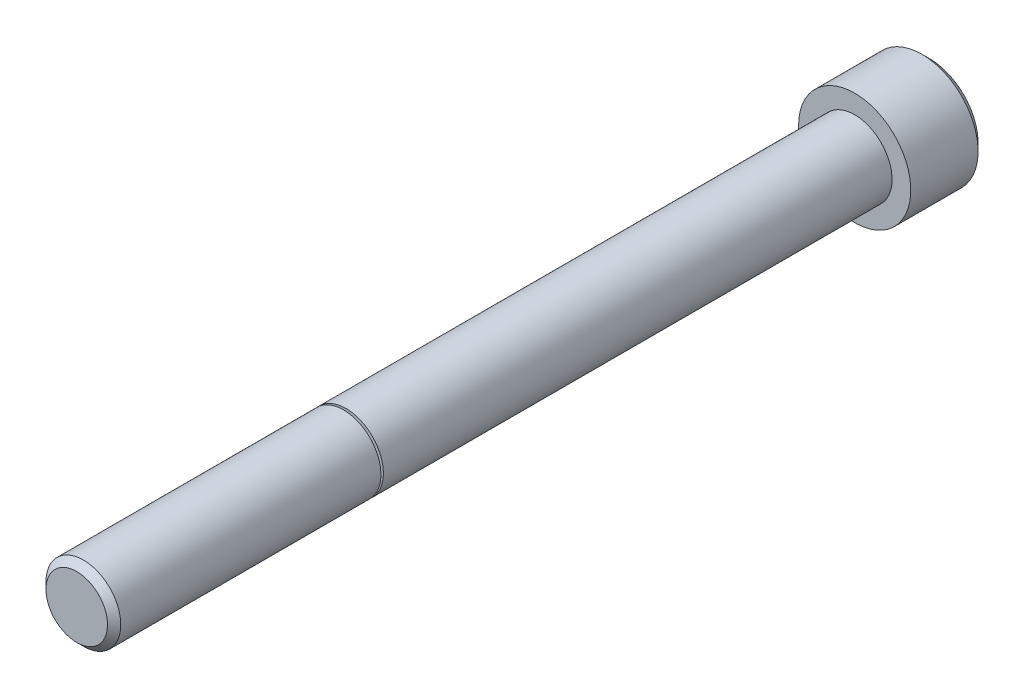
ISO-10303-21;
HEADER;
FILE_DESCRIPTION(('STEP AP214'),'2;1');
FILE_NAME('part.step','',(''),(''),'','','');
FILE_SCHEMA(('AUTOMOTIVE_DESIGN { 1 0 10303 214 1 1 1 1 }'));
ENDSEC;
DATA;
#1=APPLICATION_CONTEXT('core data for automotive mechanical design processes');
#2=APPLICATION_PROTOCOL_DEFINITION('international standard','automotive_design',2000,#1);
#3=PRODUCT_CONTEXT('',#1,'mechanical');
#4=PRODUCT('Part','Part','',(#3));
#5=PRODUCT_RELATED_PRODUCT_CATEGORY('part','',(#4));
#6=PRODUCT_DEFINITION_FORMATION('','',#4);
#7=PRODUCT_DEFINITION_CONTEXT('part definition',#1,'design');
#8=PRODUCT_DEFINITION('design','',#6,#7);
#9=PRODUCT_DEFINITION_SHAPE('','',#8);
#10=(LENGTH_UNIT() NAMED_UNIT(*) SI_UNIT(.MILLI.,.METRE.));
#11=(NAMED_UNIT(*) PLANE_ANGLE_UNIT() SI_UNIT($,.RADIAN.));
#12=(NAMED_UNIT(*) SI_UNIT($,.STERADIAN.) SOLID_ANGLE_UNIT());
#13=UNCERTAINTY_MEASURE_WITH_UNIT(LENGTH_MEASURE(1.E-05),#10,'distance_accuracy_value','');
#14=(GEOMETRIC_REPRESENTATION_CONTEXT(3) GLOBAL_UNCERTAINTY_ASSIGNED_CONTEXT((#13)) GLOBAL_UNIT_ASSIGNED_CONTEXT((#10,
#11,#12)) REPRESENTATION_CONTEXT('',''));
#15=CARTESIAN_POINT('',(0.,0.,0.));
#16=DIRECTION('',(0.,0.,1.));
#17=DIRECTION('',(1.,0.,0.));
#18=AXIS2_PLACEMENT_3D('',#15,#16,#17);
#19=CARTESIAN_POINT('',(0.,0.,-7.9375));
#20=DIRECTION('',(0.,0.,1.));
#21=DIRECTION('',(1.,0.,0.));
#22=AXIS2_PLACEMENT_3D('',#19,#20,#21);
#23=PLANE('',#22);
#24=DIRECTION('',(-0.5,-0.866025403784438,0.));
#25=VECTOR('',#24,1.);
#26=CARTESIAN_POINT('',(3.66617420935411,0.,-7.9375));
#27=LINE('',#26,#25);
#28=CARTESIAN_POINT('',(3.66617420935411,0.,-7.9375));
#29=VERTEX_POINT('',#28);
#30=CARTESIAN_POINT('',(1.83308710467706,-3.17500000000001,-7.9375));
#31=VERTEX_POINT('',#30);
#32=EDGE_CURVE('E145',#29,#31,#27,.T.);
#33=ORIENTED_EDGE('',*,*,#32,.F.);
#34=DIRECTION('',(0.499999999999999,-0.866025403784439,0.));
#35=VECTOR('',#34,1.);
#36=CARTESIAN_POINT('',(1.83308710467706,3.175,-7.9375));
#37=LINE('',#36,#35);
#38=CARTESIAN_POINT('',(1.83308710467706,3.175,-7.9375));
#39=VERTEX_POINT('',#38);
#40=EDGE_CURVE('E64',#39,#29,#37,.T.);
#41=ORIENTED_EDGE('',*,*,#40,.F.);
#42=DIRECTION('',(1.,0.,0.));
#43=VECTOR('',#42,1.);
#44=CARTESIAN_POINT('',(-1.83308710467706,3.175,-7.9375));
#45=LINE('',#44,#43);
#46=CARTESIAN_POINT('',(-1.83308710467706,3.175,-7.9375));
#47=VERTEX_POINT('',#46);
#48=EDGE_CURVE('E158',#47,#39,#45,.T.);
#49=ORIENTED_EDGE('',*,*,#48,.F.);
#50=DIRECTION('',(0.5,0.866025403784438,0.));
#51=VECTOR('',#50,1.);
#52=CARTESIAN_POINT('',(-3.66617420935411,0.,-7.9375));
#53=LINE('',#52,#51);
#54=CARTESIAN_POINT('',(-3.66617420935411,0.,-7.9375));
#55=VERTEX_POINT('',#54);
#56=EDGE_CURVE('E155',#55,#47,#53,.T.);
#57=ORIENTED_EDGE('',*,*,#56,.F.);
#58=DIRECTION('',(-0.5,0.866025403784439,0.));
#59=VECTOR('',#58,1.);
#60=CARTESIAN_POINT('',(-1.83308710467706,-3.17500000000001,-7.9375));
#61=LINE('',#60,#59);
#62=CARTESIAN_POINT('',(-1.83308710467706,-3.17500000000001,-7.9375));
#63=VERTEX_POINT('',#62);
#64=EDGE_CURVE('E112',#63,#55,#61,.T.);
#65=ORIENTED_EDGE('',*,*,#64,.F.);
#66=DIRECTION('',(-1.,0.,0.));
#67=VECTOR('',#66,1.);
#68=CARTESIAN_POINT('',(1.83308710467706,-3.17500000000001,-7.9375));
#69=LINE('',#68,#67);
#70=EDGE_CURVE('E149',#31,#63,#69,.T.);
#71=ORIENTED_EDGE('',*,*,#70,.F.);
#72=EDGE_LOOP('',(#33,#41,#49,#57,#65,#71));
#73=FACE_BOUND('',#72,.T.);
#74=CARTESIAN_POINT('',(0.,0.,-7.9375));
#75=DIRECTION('',(0.,0.,-1.));
#76=DIRECTION('',(-1.,0.,0.));
#77=AXIS2_PLACEMENT_3D('',#74,#75,#76);
#78=CIRCLE('',#77,5.15937500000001);
#79=CARTESIAN_POINT('',(-5.15937500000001,0.,-7.9375));
#80=VERTEX_POINT('',#79);
#81=EDGE_CURVE('E164',#80,#80,#78,.T.);
#82=ORIENTED_EDGE('',*,*,#81,.T.);
#83=EDGE_LOOP('',(#82));
#84=FACE_BOUND('',#83,.T.);
#85=ADVANCED_FACE('F49',(#73,#84),#23,.F.);
#86=CARTESIAN_POINT('',(-3.26390000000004,0.,82.55));
#87=DIRECTION('',(0.,0.,-1.));
#88=DIRECTION('',(-1.,0.,0.));
#89=AXIS2_PLACEMENT_3D('',#86,#87,#88);
#90=PLANE('',#89);
#91=CARTESIAN_POINT('',(0.,0.,82.55));
#92=DIRECTION('',(0.,0.,-1.));
#93=DIRECTION('',(-1.,0.,0.));
#94=AXIS2_PLACEMENT_3D('',#91,#92,#93);
#95=CIRCLE('',#94,3.26390000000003);
#96=CARTESIAN_POINT('',(-3.26390000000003,0.,82.55));
#97=VERTEX_POINT('',#96);
#98=EDGE_CURVE('E11',#97,#97,#95,.T.);
#99=ORIENTED_EDGE('',*,*,#98,.F.);
#100=EDGE_LOOP('',(#99));
#101=FACE_BOUND('',#100,.T.);
#102=ADVANCED_FACE('F214',(#101),#90,.F.);
#103=CARTESIAN_POINT('',(0.,0.,82.55));
#104=DIRECTION('',(0.,0.,-1.));
#105=DIRECTION('',(-1.,0.,0.));
#106=AXIS2_PLACEMENT_3D('',#103,#104,#105);
#107=CONICAL_SURFACE('',#106,3.26390000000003,0.785398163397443);
#108=CARTESIAN_POINT('',(0.,0.,81.84515));
#109=DIRECTION('',(0.,0.,-1.));
#110=DIRECTION('',(-1.,0.,0.));
#111=AXIS2_PLACEMENT_3D('',#108,#109,#110);
#112=CIRCLE('',#111,3.96875000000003);
#113=CARTESIAN_POINT('',(-3.96875000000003,0.,81.84515));
#114=VERTEX_POINT('',#113);
#115=EDGE_CURVE('E57',#114,#114,#112,.T.);
#116=ORIENTED_EDGE('',*,*,#115,.F.);
#117=EDGE_LOOP('',(#116));
#118=FACE_BOUND('',#117,.T.);
#119=ORIENTED_EDGE('',*,*,#98,.T.);
#120=EDGE_LOOP('',(#119));
#121=FACE_BOUND('',#120,.T.);
#122=ADVANCED_FACE('F211',(#118,#121),#107,.T.);
#123=CARTESIAN_POINT('',(0.,0.,-10.585154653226));
#124=DIRECTION('',(0.,0.,-1.));
#125=DIRECTION('',(-1.,0.,0.));
#126=AXIS2_PLACEMENT_3D('',#123,#124,#125);
#127=CYLINDRICAL_SURFACE('',#126,3.96875000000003);
#128=CARTESIAN_POINT('',(0.,0.,54.2415444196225));
#129=DIRECTION('',(0.,0.,-1.));
#130=DIRECTION('',(-1.,0.,0.));
#131=AXIS2_PLACEMENT_3D('',#128,#129,#130);
#132=CIRCLE('',#131,3.96875000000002);
#133=CARTESIAN_POINT('',(-3.96875000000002,0.,54.2415444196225));
#134=VERTEX_POINT('',#133);
#135=EDGE_CURVE('E201',#134,#134,#132,.T.);
#136=ORIENTED_EDGE('',*,*,#135,.F.);
#137=EDGE_LOOP('',(#136));
#138=FACE_BOUND('',#137,.T.);
#139=ORIENTED_EDGE('',*,*,#115,.T.);
#140=EDGE_LOOP('',(#139));
#141=FACE_BOUND('',#140,.T.);
#142=ADVANCED_FACE('F209',(#138,#141),#127,.T.);
#143=CARTESIAN_POINT('',(0.,0.,54.2415444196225));
#144=DIRECTION('',(0.,0.,1.));
#145=DIRECTION('',(1.,0.,0.));
#146=AXIS2_PLACEMENT_3D('',#143,#144,#145);
#147=CONICAL_SURFACE('',#146,3.96875000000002,1.22173047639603);
#148=CARTESIAN_POINT('',(0.,0.,54.0237938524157));
#149=DIRECTION('',(0.,0.,-1.));
#150=DIRECTION('',(-1.,0.,0.));
#151=AXIS2_PLACEMENT_3D('',#148,#149,#150);
#152=CIRCLE('',#151,3.37048523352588);
#153=CARTESIAN_POINT('',(-3.37048523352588,0.,54.0237938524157));
#154=VERTEX_POINT('',#153);
#155=EDGE_CURVE('E197',#154,#154,#152,.T.);
#156=ORIENTED_EDGE('',*,*,#155,.F.);
#157=EDGE_LOOP('',(#156));
#158=FACE_BOUND('',#157,.T.);
#159=ORIENTED_EDGE('',*,*,#135,.T.);
#160=EDGE_LOOP('',(#159));
#161=FACE_BOUND('',#160,.T.);
#162=ADVANCED_FACE('F226',(#158,#161),#147,.T.);
#163=CARTESIAN_POINT('',(0.,0.,54.005));
#164=DIRECTION('',(0.,0.,-1.));
#165=DIRECTION('',(-1.,0.,0.));
#166=AXIS2_PLACEMENT_3D('',#163,#164,#165);
#167=TOROIDAL_SURFACE('',#166,3.37732563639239,0.0199999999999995);
#168=CARTESIAN_POINT('',(0.,0.,53.985));
#169=DIRECTION('',(0.,0.,-1.));
#170=DIRECTION('',(-1.,0.,0.));
#171=AXIS2_PLACEMENT_3D('',#168,#169,#170);
#172=CIRCLE('',#171,3.37732563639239);
#173=CARTESIAN_POINT('',(-3.37732563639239,0.,53.985));
#174=VERTEX_POINT('',#173);
#175=EDGE_CURVE('E193',#174,#174,#172,.T.);
#176=ORIENTED_EDGE('',*,*,#175,.F.);
#177=EDGE_LOOP('',(#176));
#178=FACE_BOUND('',#177,.T.);
#179=ORIENTED_EDGE('',*,*,#155,.T.);
#180=EDGE_LOOP('',(#179));
#181=FACE_BOUND('',#180,.T.);
#182=ADVANCED_FACE('F230',(#178,#181),#167,.F.);
#183=CARTESIAN_POINT('',(-3.96875000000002,0.,53.985));
#184=DIRECTION('',(0.,0.,-1.));
#185=DIRECTION('',(-1.,0.,0.));
#186=AXIS2_PLACEMENT_3D('',#183,#184,#185);
#187=PLANE('',#186);
#188=CARTESIAN_POINT('',(0.,0.,53.985));
#189=DIRECTION('',(0.,0.,-1.));
#190=DIRECTION('',(-1.,0.,0.));
#191=AXIS2_PLACEMENT_3D('',#188,#189,#190);
#192=CIRCLE('',#191,3.96875000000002);
#193=CARTESIAN_POINT('',(-3.96875000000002,0.,53.985));
#194=VERTEX_POINT('',#193);
#195=EDGE_CURVE('E189',#194,#194,#192,.T.);
#196=ORIENTED_EDGE('',*,*,#195,.F.);
#197=EDGE_LOOP('',(#196));
#198=FACE_BOUND('',#197,.T.);
#199=ORIENTED_EDGE('',*,*,#175,.T.);
#200=EDGE_LOOP('',(#199));
#201=FACE_BOUND('',#200,.T.);
#202=ADVANCED_FACE('F234',(#198,#201),#187,.F.);
#203=CARTESIAN_POINT('',(0.,0.,-10.585154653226));
#204=DIRECTION('',(0.,0.,-1.));
#205=DIRECTION('',(-1.,0.,0.));
#206=AXIS2_PLACEMENT_3D('',#203,#204,#205);
#207=CYLINDRICAL_SURFACE('',#206,3.96875000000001);
#208=CARTESIAN_POINT('',(0.,0.,0.));
#209=DIRECTION('',(0.,0.,-1.));
#210=DIRECTION('',(-1.,0.,0.));
#211=AXIS2_PLACEMENT_3D('',#208,#209,#210);
#212=CIRCLE('',#211,3.96875);
#213=CARTESIAN_POINT('',(-3.96875,0.,0.));
#214=VERTEX_POINT('',#213);
#215=EDGE_CURVE('E185',#214,#214,#212,.T.);
#216=ORIENTED_EDGE('',*,*,#215,.F.);
#217=EDGE_LOOP('',(#216));
#218=FACE_BOUND('',#217,.T.);
#219=ORIENTED_EDGE('',*,*,#195,.T.);
#220=EDGE_LOOP('',(#219));
#221=FACE_BOUND('',#220,.T.);
#222=ADVANCED_FACE('F238',(#218,#221),#207,.T.);
#223=CARTESIAN_POINT('',(-5.953125,0.,0.));
#224=DIRECTION('',(0.,0.,-1.));
#225=DIRECTION('',(-1.,0.,0.));
#226=AXIS2_PLACEMENT_3D('',#223,#224,#225);
#227=PLANE('',#226);
#228=CARTESIAN_POINT('',(0.,0.,0.));
#229=DIRECTION('',(0.,0.,-1.));
#230=DIRECTION('',(-1.,0.,0.));
#231=AXIS2_PLACEMENT_3D('',#228,#229,#230);
#232=CIRCLE('',#231,5.95312500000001);
#233=CARTESIAN_POINT('',(-5.95312500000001,0.,0.));
#234=VERTEX_POINT('',#233);
#235=EDGE_CURVE('E181',#234,#234,#232,.T.);
#236=ORIENTED_EDGE('',*,*,#235,.F.);
#237=EDGE_LOOP('',(#236));
#238=FACE_BOUND('',#237,.T.);
#239=ORIENTED_EDGE('',*,*,#215,.T.);
#240=EDGE_LOOP('',(#239));
#241=FACE_BOUND('',#240,.T.);
#242=ADVANCED_FACE('F242',(#238,#241),#227,.F.);
#243=CARTESIAN_POINT('',(0.,0.,-10.585154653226));
#244=DIRECTION('',(0.,0.,-1.));
#245=DIRECTION('',(-1.,0.,0.));
#246=AXIS2_PLACEMENT_3D('',#243,#244,#245);
#247=CYLINDRICAL_SURFACE('',#246,5.953125);
#248=CARTESIAN_POINT('',(0.,0.,-7.14375));
#249=DIRECTION('',(0.,0.,-1.));
#250=DIRECTION('',(-1.,0.,0.));
#251=AXIS2_PLACEMENT_3D('',#248,#249,#250);
#252=CIRCLE('',#251,5.953125);
#253=CARTESIAN_POINT('',(-5.953125,0.,-7.14375));
#254=VERTEX_POINT('',#253);
#255=EDGE_CURVE('E177',#254,#254,#252,.T.);
#256=ORIENTED_EDGE('',*,*,#255,.F.);
#257=EDGE_LOOP('',(#256));
#258=FACE_BOUND('',#257,.T.);
#259=ORIENTED_EDGE('',*,*,#235,.T.);
#260=EDGE_LOOP('',(#259));
#261=FACE_BOUND('',#260,.T.);
#262=ADVANCED_FACE('F246',(#258,#261),#247,.T.);
#263=CARTESIAN_POINT('',(0.,0.,-7.14375));
#264=DIRECTION('',(0.,0.,1.));
#265=DIRECTION('',(1.,0.,0.));
#266=AXIS2_PLACEMENT_3D('',#263,#264,#265);
#267=CONICAL_SURFACE('',#266,5.953125,0.785398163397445);
#268=ORIENTED_EDGE('',*,*,#81,.F.);
#269=EDGE_LOOP('',(#268));
#270=FACE_BOUND('',#269,.T.);
#271=ORIENTED_EDGE('',*,*,#255,.T.);
#272=EDGE_LOOP('',(#271));
#273=FACE_BOUND('',#272,.T.);
#274=ADVANCED_FACE('F250',(#270,#273),#267,.T.);
#275=CARTESIAN_POINT('',(1.83308710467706,3.175,-3.96875));
#276=DIRECTION('',(0.866025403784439,0.5,0.));
#277=DIRECTION('',(-0.5,0.866025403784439,0.));
#278=AXIS2_PLACEMENT_3D('',#275,#276,#277);
#279=PLANE('',#278);
#280=ORIENTED_EDGE('',*,*,#40,.T.);
#281=DIRECTION('',(0.,0.,-1.));
#282=VECTOR('',#281,1.);
#283=CARTESIAN_POINT('',(3.66617420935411,0.,-3.96875));
#284=LINE('',#283,#282);
#285=CARTESIAN_POINT('',(3.66617420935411,0.,-3.96875));
#286=VERTEX_POINT('',#285);
#287=EDGE_CURVE('E94',#286,#29,#284,.T.);
#288=ORIENTED_EDGE('',*,*,#287,.F.);
#289=DIRECTION('',(0.499999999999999,-0.866025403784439,0.));
#290=VECTOR('',#289,1.);
#291=CARTESIAN_POINT('',(1.83308710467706,3.175,-3.96875));
#292=LINE('',#291,#290);
#293=CARTESIAN_POINT('',(1.83308710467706,3.175,-3.96875));
#294=VERTEX_POINT('',#293);
#295=EDGE_CURVE('E161',#294,#286,#292,.T.);
#296=ORIENTED_EDGE('',*,*,#295,.F.);
#297=DIRECTION('',(0.,0.,-1.));
#298=VECTOR('',#297,1.);
#299=CARTESIAN_POINT('',(1.83308710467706,3.175,-3.96875));
#300=LINE('',#299,#298);
#301=EDGE_CURVE('E72',#294,#39,#300,.T.);
#302=ORIENTED_EDGE('',*,*,#301,.T.);
#303=EDGE_LOOP('',(#280,#288,#296,#302));
#304=FACE_BOUND('',#303,.T.);
#305=ADVANCED_FACE('F254',(#304),#279,.F.);
#306=CARTESIAN_POINT('',(-1.83308710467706,3.175,-3.96875));
#307=DIRECTION('',(0.,1.,0.));
#308=DIRECTION('',(-1.,0.,0.));
#309=AXIS2_PLACEMENT_3D('',#306,#307,#308);
#310=PLANE('',#309);
#311=ORIENTED_EDGE('',*,*,#48,.T.);
#312=ORIENTED_EDGE('',*,*,#301,.F.);
#313=DIRECTION('',(1.,0.,0.));
#314=VECTOR('',#313,1.);
#315=CARTESIAN_POINT('',(-1.83308710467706,3.175,-3.96875));
#316=LINE('',#315,#314);
#317=CARTESIAN_POINT('',(-1.83308710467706,3.175,-3.96875));
#318=VERTEX_POINT('',#317);
#319=EDGE_CURVE('E126',#318,#294,#316,.T.);
#320=ORIENTED_EDGE('',*,*,#319,.F.);
#321=DIRECTION('',(0.,0.,-1.));
#322=VECTOR('',#321,1.);
#323=CARTESIAN_POINT('',(-1.83308710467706,3.175,-3.96875));
#324=LINE('',#323,#322);
#325=EDGE_CURVE('E117',#318,#47,#324,.T.);
#326=ORIENTED_EDGE('',*,*,#325,.T.);
#327=EDGE_LOOP('',(#311,#312,#320,#326));
#328=FACE_BOUND('',#327,.T.);
#329=ADVANCED_FACE('F258',(#328),#310,.F.);
#330=CARTESIAN_POINT('',(-3.66617420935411,0.,-3.96875));
#331=DIRECTION('',(-0.866025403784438,0.5,0.));
#332=DIRECTION('',(-0.5,-0.866025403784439,0.));
#333=AXIS2_PLACEMENT_3D('',#330,#331,#332);
#334=PLANE('',#333);
#335=ORIENTED_EDGE('',*,*,#56,.T.);
#336=ORIENTED_EDGE('',*,*,#325,.F.);
#337=DIRECTION('',(0.5,0.866025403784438,0.));
#338=VECTOR('',#337,1.);
#339=CARTESIAN_POINT('',(-3.66617420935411,0.,-3.96875));
#340=LINE('',#339,#338);
#341=CARTESIAN_POINT('',(-3.66617420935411,0.,-3.96875));
#342=VERTEX_POINT('',#341);
#343=EDGE_CURVE('E121',#342,#318,#340,.T.);
#344=ORIENTED_EDGE('',*,*,#343,.F.);
#345=DIRECTION('',(0.,0.,-1.));
#346=VECTOR('',#345,1.);
#347=CARTESIAN_POINT('',(-3.66617420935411,0.,-3.96875));
#348=LINE('',#347,#346);
#349=EDGE_CURVE('E105',#342,#55,#348,.T.);
#350=ORIENTED_EDGE('',*,*,#349,.T.);
#351=EDGE_LOOP('',(#335,#336,#344,#350));
#352=FACE_BOUND('',#351,.T.);
#353=ADVANCED_FACE('F122',(#352),#334,.F.);
#354=CARTESIAN_POINT('',(-1.83308710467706,-3.17500000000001,-3.96875));
#355=DIRECTION('',(-0.866025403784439,-0.5,0.));
#356=DIRECTION('',(0.5,-0.866025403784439,0.));
#357=AXIS2_PLACEMENT_3D('',#354,#355,#356);
#358=PLANE('',#357);
#359=ORIENTED_EDGE('',*,*,#64,.T.);
#360=ORIENTED_EDGE('',*,*,#349,.F.);
#361=DIRECTION('',(-0.5,0.866025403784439,0.));
#362=VECTOR('',#361,1.);
#363=CARTESIAN_POINT('',(-1.83308710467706,-3.17500000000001,-3.96875));
#364=LINE('',#363,#362);
#365=CARTESIAN_POINT('',(-1.83308710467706,-3.17500000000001,-3.96875));
#366=VERTEX_POINT('',#365);
#367=EDGE_CURVE('E109',#366,#342,#364,.T.);
#368=ORIENTED_EDGE('',*,*,#367,.F.);
#369=DIRECTION('',(0.,0.,-1.));
#370=VECTOR('',#369,1.);
#371=CARTESIAN_POINT('',(-1.83308710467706,-3.17500000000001,-3.96875));
#372=LINE('',#371,#370);
#373=EDGE_CURVE('E118',#366,#63,#372,.T.);
#374=ORIENTED_EDGE('',*,*,#373,.T.);
#375=EDGE_LOOP('',(#359,#360,#368,#374));
#376=FACE_BOUND('',#375,.T.);
#377=ADVANCED_FACE('F107',(#376),#358,.F.);
#378=CARTESIAN_POINT('',(1.83308710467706,-3.17500000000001,-3.96875));
#379=DIRECTION('',(0.,-1.,0.));
#380=DIRECTION('',(0.,0.,-1.));
#381=AXIS2_PLACEMENT_3D('',#378,#379,#380);
#382=PLANE('',#381);
#383=ORIENTED_EDGE('',*,*,#70,.T.);
#384=ORIENTED_EDGE('',*,*,#373,.F.);
#385=DIRECTION('',(-1.,0.,0.));
#386=VECTOR('',#385,1.);
#387=CARTESIAN_POINT('',(1.83308710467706,-3.17500000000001,-3.96875));
#388=LINE('',#387,#386);
#389=CARTESIAN_POINT('',(1.83308710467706,-3.17500000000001,-3.96875));
#390=VERTEX_POINT('',#389);
#391=EDGE_CURVE('E132',#390,#366,#388,.T.);
#392=ORIENTED_EDGE('',*,*,#391,.F.);
#393=DIRECTION('',(0.,0.,-1.));
#394=VECTOR('',#393,1.);
#395=CARTESIAN_POINT('',(1.83308710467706,-3.17500000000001,-3.96875));
#396=LINE('',#395,#394);
#397=EDGE_CURVE('E169',#390,#31,#396,.T.);
#398=ORIENTED_EDGE('',*,*,#397,.T.);
#399=EDGE_LOOP('',(#383,#384,#392,#398));
#400=FACE_BOUND('',#399,.T.);
#401=ADVANCED_FACE('F262',(#400),#382,.F.);
#402=CARTESIAN_POINT('',(3.66617420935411,0.,-3.96875));
#403=DIRECTION('',(0.866025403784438,-0.5,0.));
#404=DIRECTION('',(0.5,0.866025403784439,0.));
#405=AXIS2_PLACEMENT_3D('',#402,#403,#404);
#406=PLANE('',#405);
#407=ORIENTED_EDGE('',*,*,#32,.T.);
#408=ORIENTED_EDGE('',*,*,#397,.F.);
#409=DIRECTION('',(-0.5,-0.866025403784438,0.));
#410=VECTOR('',#409,1.);
#411=CARTESIAN_POINT('',(3.66617420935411,0.,-3.96875));
#412=LINE('',#411,#410);
#413=EDGE_CURVE('E137',#286,#390,#412,.T.);
#414=ORIENTED_EDGE('',*,*,#413,.F.);
#415=ORIENTED_EDGE('',*,*,#287,.T.);
#416=EDGE_LOOP('',(#407,#408,#414,#415));
#417=FACE_BOUND('',#416,.T.);
#418=ADVANCED_FACE('F259',(#417),#406,.F.);
#419=CARTESIAN_POINT('',(1.83308710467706,3.175,-3.96875));
#420=DIRECTION('',(0.,0.,1.));
#421=DIRECTION('',(1.,0.,0.));
#422=AXIS2_PLACEMENT_3D('',#419,#420,#421);
#423=PLANE('',#422);
#424=ORIENTED_EDGE('',*,*,#295,.T.);
#425=ORIENTED_EDGE('',*,*,#413,.T.);
#426=ORIENTED_EDGE('',*,*,#391,.T.);
#427=ORIENTED_EDGE('',*,*,#367,.T.);
#428=ORIENTED_EDGE('',*,*,#343,.T.);
#429=ORIENTED_EDGE('',*,*,#319,.T.);
#430=EDGE_LOOP('',(#424,#425,#426,#427,#428,#429));
#431=FACE_BOUND('',#430,.T.);
#432=ADVANCED_FACE('F129',(#431),#423,.F.);
#433=CLOSED_SHELL('',(#85,#102,#122,#142,#162,#182,#202,#222,#242,#262,#274,#305,#329,#353,#377,
#401,#418,#432));
#434=MANIFOLD_SOLID_BREP('B2',#433);
#435=ADVANCED_BREP_SHAPE_REPRESENTATION('',(#18,#434),#14);
#436=SHAPE_DEFINITION_REPRESENTATION(#9,#435);
ENDSEC;
END-ISO-10303-21;
